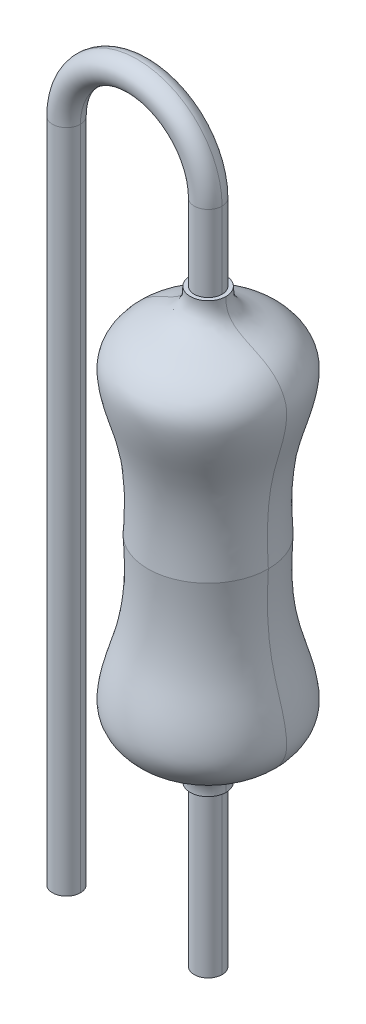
ISO-10303-21;
HEADER;
FILE_DESCRIPTION(('STEP AP214'),'2;1');
FILE_NAME('part.step','',(''),(''),'','','');
FILE_SCHEMA(('AUTOMOTIVE_DESIGN { 1 0 10303 214 1 1 1 1 }'));
ENDSEC;
DATA;
#1=APPLICATION_CONTEXT('core data for automotive mechanical design processes');
#2=APPLICATION_PROTOCOL_DEFINITION('international standard','automotive_design',2000,#1);
#3=PRODUCT_CONTEXT('',#1,'mechanical');
#4=PRODUCT('Part','Part','',(#3));
#5=PRODUCT_RELATED_PRODUCT_CATEGORY('part','',(#4));
#6=PRODUCT_DEFINITION_FORMATION('','',#4);
#7=PRODUCT_DEFINITION_CONTEXT('part definition',#1,'design');
#8=PRODUCT_DEFINITION('design','',#6,#7);
#9=PRODUCT_DEFINITION_SHAPE('','',#8);
#10=(LENGTH_UNIT() NAMED_UNIT(*) SI_UNIT(.MILLI.,.METRE.));
#11=(NAMED_UNIT(*) PLANE_ANGLE_UNIT() SI_UNIT($,.RADIAN.));
#12=(NAMED_UNIT(*) SI_UNIT($,.STERADIAN.) SOLID_ANGLE_UNIT());
#13=UNCERTAINTY_MEASURE_WITH_UNIT(LENGTH_MEASURE(1.E-05),#10,'distance_accuracy_value','');
#14=(GEOMETRIC_REPRESENTATION_CONTEXT(3) GLOBAL_UNCERTAINTY_ASSIGNED_CONTEXT((#13)) GLOBAL_UNIT_ASSIGNED_CONTEXT((#10,
#11,#12)) REPRESENTATION_CONTEXT('',''));
#15=CARTESIAN_POINT('',(0.,0.,0.));
#16=DIRECTION('',(0.,0.,1.));
#17=DIRECTION('',(1.,0.,0.));
#18=AXIS2_PLACEMENT_3D('',#15,#16,#17);
#19=CARTESIAN_POINT('',(0.,4.62500000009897,0.600000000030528));
#20=DIRECTION('',(-1.,0.,0.));
#21=DIRECTION('',(0.,0.,1.));
#22=AXIS2_PLACEMENT_3D('',#19,#20,#21);
#23=CIRCLE('',#22,1.62500000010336);
#24=TRIMMED_CURVE('',#23,(PARAMETER_VALUE(-1.94897749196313)),
(PARAMETER_VALUE(1.94897749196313)),.T.,.PARAMETER.);
#25=CARTESIAN_POINT('',(0.,4.62500000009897,0.));
#26=DIRECTION('',(0.,1.,0.));
#27=AXIS1_PLACEMENT('',#25,#26);
#28=SURFACE_OF_REVOLUTION('',#24,#27);
#29=CARTESIAN_POINT('',(0.,3.038139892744,0.));
#30=DIRECTION('',(0.,1.,0.));
#31=DIRECTION('',(-1.,0.,0.));
#32=AXIS2_PLACEMENT_3D('',#29,#30,#31);
#33=CIRCLE('',#32,0.25);
#34=CARTESIAN_POINT('',(-0.250000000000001,3.03813989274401,0.));
#35=VERTEX_POINT('',#34);
#36=CARTESIAN_POINT('',(0.250000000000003,3.038139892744,0.));
#37=VERTEX_POINT('',#36);
#38=EDGE_CURVE('P0_E58',#35,#37,#33,.T.);
#39=ORIENTED_EDGE('',*,*,#38,.F.);
#40=CARTESIAN_POINT('',(-0.600000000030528,4.62500000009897,0.));
#41=DIRECTION('',(0.,0.,-1.));
#42=DIRECTION('',(-1.,0.,0.));
#43=AXIS2_PLACEMENT_3D('',#40,#41,#42);
#44=CIRCLE('',#43,1.62500000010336);
#45=CARTESIAN_POINT('',(0.,3.11482616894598,0.));
#46=VERTEX_POINT('',#45);
#47=EDGE_CURVE('P0_E61',#46,#35,#44,.T.);
#48=ORIENTED_EDGE('',*,*,#47,.F.);
#49=CARTESIAN_POINT('',(0.60000000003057,4.62500000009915,0.));
#50=DIRECTION('',(0.,0.,-1.));
#51=DIRECTION('',(-1.,0.,0.));
#52=AXIS2_PLACEMENT_3D('',#49,#50,#51);
#53=CIRCLE('',#52,1.62500000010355);
#54=EDGE_CURVE('P0_E63',#37,#46,#53,.T.);
#55=ORIENTED_EDGE('',*,*,#54,.F.);
#56=EDGE_LOOP('',(#39,#48,#55));
#57=FACE_BOUND('',#56,.T.);
#58=ADVANCED_FACE('P0_F17',(#57),#28,.T.);
#59=CARTESIAN_POINT('',(0.,-6.6,0.));
#60=DIRECTION('',(0.,1.,0.));
#61=DIRECTION('',(-1.,0.,0.));
#62=AXIS2_PLACEMENT_3D('',#59,#60,#61);
#63=CYLINDRICAL_SURFACE('',#62,0.25);
#64=ORIENTED_EDGE('',*,*,#38,.T.);
#65=DIRECTION('',(0.,1.,0.));
#66=VECTOR('',#65,1.);
#67=CARTESIAN_POINT('',(0.250000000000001,-6.6,0.));
#68=LINE('',#67,#66);
#69=CARTESIAN_POINT('',(0.25,5.33,0.));
#70=VERTEX_POINT('',#69);
#71=EDGE_CURVE('P0_E76',#70,#37,#68,.F.);
#72=ORIENTED_EDGE('',*,*,#71,.F.);
#73=CARTESIAN_POINT('',(0.,5.33,0.));
#74=DIRECTION('',(0.,1.,0.));
#75=DIRECTION('',(0.,0.,1.));
#76=AXIS2_PLACEMENT_3D('',#73,#74,#75);
#77=CIRCLE('',#76,0.25);
#78=CARTESIAN_POINT('',(-0.25,5.33,0.));
#79=VERTEX_POINT('',#78);
#80=EDGE_CURVE('P0_E70',#79,#70,#77,.T.);
#81=ORIENTED_EDGE('',*,*,#80,.F.);
#82=DIRECTION('',(0.,1.,0.));
#83=VECTOR('',#82,1.);
#84=CARTESIAN_POINT('',(-0.249999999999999,-6.6,0.));
#85=LINE('',#84,#83);
#86=EDGE_CURVE('P0_E68',#35,#79,#85,.T.);
#87=ORIENTED_EDGE('',*,*,#86,.F.);
#88=EDGE_LOOP('',(#64,#72,#81,#87));
#89=FACE_BOUND('',#88,.T.);
#90=ADVANCED_FACE('P0_F69',(#89),#63,.T.);
#91=CARTESIAN_POINT('',(0.,4.62500000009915,0.60000000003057));
#92=DIRECTION('',(-1.,0.,0.));
#93=DIRECTION('',(0.,0.,1.));
#94=AXIS2_PLACEMENT_3D('',#91,#92,#93);
#95=CIRCLE('',#94,1.62500000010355);
#96=TRIMMED_CURVE('',#95,(PARAMETER_VALUE(-1.94897749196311)),
(PARAMETER_VALUE(1.94897749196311)),.T.,.PARAMETER.);
#97=CARTESIAN_POINT('',(0.,4.62500000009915,0.));
#98=DIRECTION('',(0.,1.,0.));
#99=AXIS1_PLACEMENT('',#97,#98);
#100=SURFACE_OF_REVOLUTION('',#96,#99);
#101=ORIENTED_EDGE('',*,*,#54,.T.);
#102=ORIENTED_EDGE('',*,*,#47,.T.);
#103=CARTESIAN_POINT('',(0.,3.038139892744,0.));
#104=DIRECTION('',(0.,1.,0.));
#105=DIRECTION('',(-1.,0.,0.));
#106=AXIS2_PLACEMENT_3D('',#103,#104,#105);
#107=CIRCLE('',#106,0.25);
#108=EDGE_CURVE('P0_E80',#37,#35,#107,.T.);
#109=ORIENTED_EDGE('',*,*,#108,.F.);
#110=EDGE_LOOP('',(#101,#102,#109));
#111=FACE_BOUND('',#110,.T.);
#112=ADVANCED_FACE('P0_F79',(#111),#100,.T.);
#113=CARTESIAN_POINT('',(-1.27,5.33,0.));
#114=DIRECTION('',(0.,0.,1.));
#115=DIRECTION('',(0.,-1.,0.));
#116=AXIS2_PLACEMENT_3D('',#113,#114,#115);
#117=TOROIDAL_SURFACE('',#116,1.27,0.25);
#118=ORIENTED_EDGE('',*,*,#80,.T.);
#119=CARTESIAN_POINT('',(-1.27,5.33,0.));
#120=DIRECTION('',(0.,0.,-1.));
#121=DIRECTION('',(-1.,0.,0.));
#122=AXIS2_PLACEMENT_3D('',#119,#120,#121);
#123=CIRCLE('',#122,1.52);
#124=CARTESIAN_POINT('',(-2.79,5.33,0.));
#125=VERTEX_POINT('',#124);
#126=EDGE_CURVE('P0_E36',#125,#70,#123,.T.);
#127=ORIENTED_EDGE('',*,*,#126,.F.);
#128=CARTESIAN_POINT('',(-2.54,5.33,0.));
#129=DIRECTION('',(0.,-1.,0.));
#130=DIRECTION('',(1.,0.,0.));
#131=AXIS2_PLACEMENT_3D('',#128,#129,#130);
#132=CIRCLE('',#131,0.25);
#133=CARTESIAN_POINT('',(-2.29,5.33,0.));
#134=VERTEX_POINT('',#133);
#135=EDGE_CURVE('P0_E86',#134,#125,#132,.T.);
#136=ORIENTED_EDGE('',*,*,#135,.F.);
#137=CARTESIAN_POINT('',(-1.27,5.33,0.));
#138=DIRECTION('',(0.,0.,1.));
#139=DIRECTION('',(0.,-1.,0.));
#140=AXIS2_PLACEMENT_3D('',#137,#138,#139);
#141=CIRCLE('',#140,1.02);
#142=EDGE_CURVE('P0_E115',#79,#134,#141,.T.);
#143=ORIENTED_EDGE('',*,*,#142,.F.);
#144=EDGE_LOOP('',(#118,#127,#136,#143));
#145=FACE_BOUND('',#144,.T.);
#146=ADVANCED_FACE('P0_F141',(#145),#117,.T.);
#147=CARTESIAN_POINT('',(0.,-6.6,0.));
#148=DIRECTION('',(0.,1.,0.));
#149=DIRECTION('',(-1.,0.,0.));
#150=AXIS2_PLACEMENT_3D('',#147,#148,#149);
#151=CYLINDRICAL_SURFACE('',#150,0.25);
#152=ORIENTED_EDGE('',*,*,#71,.T.);
#153=ORIENTED_EDGE('',*,*,#108,.T.);
#154=ORIENTED_EDGE('',*,*,#86,.T.);
#155=CARTESIAN_POINT('',(0.,5.33,0.));
#156=DIRECTION('',(0.,1.,0.));
#157=DIRECTION('',(0.,0.,1.));
#158=AXIS2_PLACEMENT_3D('',#155,#156,#157);
#159=CIRCLE('',#158,0.25);
#160=EDGE_CURVE('P0_E105',#70,#79,#159,.T.);
#161=ORIENTED_EDGE('',*,*,#160,.F.);
#162=EDGE_LOOP('',(#152,#153,#154,#161));
#163=FACE_BOUND('',#162,.T.);
#164=ADVANCED_FACE('P0_F83',(#163),#151,.T.);
#165=CARTESIAN_POINT('',(-2.54,-6.6,0.));
#166=DIRECTION('',(0.,-1.,0.));
#167=DIRECTION('',(1.,0.,0.));
#168=AXIS2_PLACEMENT_3D('',#165,#166,#167);
#169=PLANE('',#168);
#170=CARTESIAN_POINT('',(-2.54,-6.6,0.));
#171=DIRECTION('',(0.,-1.,0.));
#172=DIRECTION('',(1.,0.,0.));
#173=AXIS2_PLACEMENT_3D('',#170,#171,#172);
#174=CIRCLE('',#173,0.25);
#175=CARTESIAN_POINT('',(-2.79,-6.6,0.));
#176=VERTEX_POINT('',#175);
#177=CARTESIAN_POINT('',(-2.29,-6.6,0.));
#178=VERTEX_POINT('',#177);
#179=EDGE_CURVE('P0_E21',#176,#178,#174,.F.);
#180=ORIENTED_EDGE('',*,*,#179,.F.);
#181=CARTESIAN_POINT('',(-2.54,-6.6,0.));
#182=DIRECTION('',(0.,-1.,0.));
#183=DIRECTION('',(1.,0.,0.));
#184=AXIS2_PLACEMENT_3D('',#181,#182,#183);
#185=CIRCLE('',#184,0.25);
#186=EDGE_CURVE('P0_E97',#178,#176,#185,.F.);
#187=ORIENTED_EDGE('',*,*,#186,.F.);
#188=EDGE_LOOP('',(#180,#187));
#189=FACE_BOUND('',#188,.T.);
#190=ADVANCED_FACE('P0_F148',(#189),#169,.T.);
#191=CARTESIAN_POINT('',(-2.54,5.33,0.));
#192=DIRECTION('',(0.,-1.,0.));
#193=DIRECTION('',(1.,0.,0.));
#194=AXIS2_PLACEMENT_3D('',#191,#192,#193);
#195=CYLINDRICAL_SURFACE('',#194,0.25);
#196=ORIENTED_EDGE('',*,*,#135,.T.);
#197=DIRECTION('',(0.,-1.,0.));
#198=VECTOR('',#197,1.);
#199=CARTESIAN_POINT('',(-2.79,5.33,0.));
#200=LINE('',#199,#198);
#201=EDGE_CURVE('P0_E27',#176,#125,#200,.F.);
#202=ORIENTED_EDGE('',*,*,#201,.F.);
#203=ORIENTED_EDGE('',*,*,#179,.T.);
#204=DIRECTION('',(0.,-1.,0.));
#205=VECTOR('',#204,1.);
#206=CARTESIAN_POINT('',(-2.29,5.33,0.));
#207=LINE('',#206,#205);
#208=EDGE_CURVE('P0_E99',#134,#178,#207,.T.);
#209=ORIENTED_EDGE('',*,*,#208,.F.);
#210=EDGE_LOOP('',(#196,#202,#203,#209));
#211=FACE_BOUND('',#210,.T.);
#212=ADVANCED_FACE('P0_F140',(#211),#195,.T.);
#213=CARTESIAN_POINT('',(-1.27,5.33,0.));
#214=DIRECTION('',(0.,0.,1.));
#215=DIRECTION('',(1.,0.,0.));
#216=AXIS2_PLACEMENT_3D('',#213,#214,#215);
#217=TOROIDAL_SURFACE('',#216,1.27,0.25);
#218=ORIENTED_EDGE('',*,*,#126,.T.);
#219=ORIENTED_EDGE('',*,*,#160,.T.);
#220=ORIENTED_EDGE('',*,*,#142,.T.);
#221=CARTESIAN_POINT('',(-2.54,5.33,0.));
#222=DIRECTION('',(0.,-1.,0.));
#223=DIRECTION('',(1.,0.,0.));
#224=AXIS2_PLACEMENT_3D('',#221,#222,#223);
#225=CIRCLE('',#224,0.25);
#226=EDGE_CURVE('P0_E11',#125,#134,#225,.T.);
#227=ORIENTED_EDGE('',*,*,#226,.F.);
#228=EDGE_LOOP('',(#218,#219,#220,#227));
#229=FACE_BOUND('',#228,.T.);
#230=ADVANCED_FACE('P0_F19',(#229),#217,.T.);
#231=CARTESIAN_POINT('',(-2.54,5.33,0.));
#232=DIRECTION('',(0.,-1.,0.));
#233=DIRECTION('',(1.,0.,0.));
#234=AXIS2_PLACEMENT_3D('',#231,#232,#233);
#235=CYLINDRICAL_SURFACE('',#234,0.25);
#236=ORIENTED_EDGE('',*,*,#201,.T.);
#237=ORIENTED_EDGE('',*,*,#226,.T.);
#238=ORIENTED_EDGE('',*,*,#208,.T.);
#239=ORIENTED_EDGE('',*,*,#186,.T.);
#240=EDGE_LOOP('',(#236,#237,#238,#239));
#241=FACE_BOUND('',#240,.T.);
#242=ADVANCED_FACE('P0_F138',(#241),#235,.T.);
#243=CLOSED_SHELL('',(#58,#90,#112,#146,#164,#190,#212,#230,#242));
#244=MANIFOLD_SOLID_BREP('P0_B1',#243);
#245=CARTESIAN_POINT('',(-0.0007931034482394,3.961860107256,0.));
#246=DIRECTION('',(0.,1.,0.));
#247=DIRECTION('',(-1.,0.,0.));
#248=AXIS2_PLACEMENT_3D('',#245,#246,#247);
#249=PLANE('',#248);
#250=CARTESIAN_POINT('',(-0.320793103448,3.961860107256,0.));
#251=CARTESIAN_POINT('',(-0.320808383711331,3.961860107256,0.018002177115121));
#252=CARTESIAN_POINT('',(-0.319274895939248,3.961860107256,0.0359997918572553));
#253=CARTESIAN_POINT('',(-0.313223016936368,3.961860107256,0.0714731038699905));
#254=CARTESIAN_POINT('',(-0.30870681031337,3.961860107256,0.0889491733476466));
#255=CARTESIAN_POINT('',(-0.296799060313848,3.961860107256,0.122902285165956));
#256=CARTESIAN_POINT('',(-0.289406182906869,3.961860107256,0.139378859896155));
#257=CARTESIAN_POINT('',(-0.271961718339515,3.961860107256,0.170854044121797));
#258=CARTESIAN_POINT('',(-0.261910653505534,3.961860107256,0.18585294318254));
#259=CARTESIAN_POINT('',(-0.239439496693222,3.961860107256,0.213942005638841));
#260=CARTESIAN_POINT('',(-0.227020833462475,3.961860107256,0.227033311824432));
#261=CARTESIAN_POINT('',(-0.200145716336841,3.961860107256,0.250963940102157));
#262=CARTESIAN_POINT('',(-0.1856864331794,3.961860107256,0.261800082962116));
#263=CARTESIAN_POINT('',(-0.155169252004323,3.961860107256,0.280874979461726));
#264=CARTESIAN_POINT('',(-0.139113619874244,3.961860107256,0.289117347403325));
#265=CARTESIAN_POINT('',(-0.105842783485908,3.961860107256,0.302804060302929));
#266=CARTESIAN_POINT('',(-0.0886259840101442,3.961860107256,0.308244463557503));
#267=CARTESIAN_POINT('',(-0.0360139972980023,3.961860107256,0.320061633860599));
#268=CARTESIAN_POINT('',(0.000479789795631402,3.961860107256,0.32201854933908));
#269=CARTESIAN_POINT('',(0.0720386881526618,3.961860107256,0.313676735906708));
#270=CARTESIAN_POINT('',(0.10710379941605,3.961860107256,0.303378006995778));
#271=CARTESIAN_POINT('',(0.155586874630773,3.961860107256,0.279775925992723));
#272=CARTESIAN_POINT('',(0.171090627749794,3.961860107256,0.270521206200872));
#273=CARTESIAN_POINT('',(0.200321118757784,3.961860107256,0.24954853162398));
#274=CARTESIAN_POINT('',(0.214050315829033,3.961860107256,0.237834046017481));
#275=CARTESIAN_POINT('',(0.239361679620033,3.961860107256,0.212251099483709));
#276=CARTESIAN_POINT('',(0.250940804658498,3.961860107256,0.198379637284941));
#277=CARTESIAN_POINT('',(0.271590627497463,3.961860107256,0.16890867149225));
#278=CARTESIAN_POINT('',(0.280664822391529,3.961860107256,0.153311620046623));
#279=CARTESIAN_POINT('',(0.296079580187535,3.961860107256,0.120793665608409));
#280=CARTESIAN_POINT('',(0.302416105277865,3.961860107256,0.103870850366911));
#281=CARTESIAN_POINT('',(0.312145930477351,3.961860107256,0.0692226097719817));
#282=CARTESIAN_POINT('',(0.315543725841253,3.961860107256,0.051498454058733));
#283=CARTESIAN_POINT('',(0.318617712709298,3.961860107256,0.022453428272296));
#284=CARTESIAN_POINT('',(0.319211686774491,3.961860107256,0.0112237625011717));
#285=CARTESIAN_POINT('',(0.319206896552,3.961860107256,0.));
#286=B_SPLINE_CURVE_WITH_KNOTS('',3,(#250,#251,#252,#253,#254,#255,#256,#257,#258,#259,#260,
#261,#262,#263,#264,#265,#266,#267,#268,#269,#270,#271,#272,#273,#274,#275,#276,#277,#278,#279,
#280,#281,#282,#283,#284,#285),.UNSPECIFIED.,.F.,.F.,(4,2,2,2,2,2,2,2,2,2,2,2,2,2,2,2,2,4),(0.,
0.0539348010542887,0.107830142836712,0.161750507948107,0.215660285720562,0.269537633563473,
0.323490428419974,0.377367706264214,0.431320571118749,0.538767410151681,0.646214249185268,
0.700167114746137,0.754044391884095,0.807997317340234,0.861874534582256,0.91583094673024,
0.969704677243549,1.00337593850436),.UNSPECIFIED.);
#287=CARTESIAN_POINT('',(-0.320793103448,3.961860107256,0.));
#288=VERTEX_POINT('',#287);
#289=CARTESIAN_POINT('',(0.319206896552,3.961860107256,0.));
#290=VERTEX_POINT('',#289);
#291=EDGE_CURVE('P1_E21',#288,#290,#286,.T.);
#292=ORIENTED_EDGE('',*,*,#291,.T.);
#293=CARTESIAN_POINT('',(0.319206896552,3.961860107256,0.));
#294=CARTESIAN_POINT('',(0.319222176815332,3.961860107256,-0.018002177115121));
#295=CARTESIAN_POINT('',(0.317688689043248,3.961860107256,-0.0359997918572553));
#296=CARTESIAN_POINT('',(0.311636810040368,3.961860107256,-0.0714731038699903));
#297=CARTESIAN_POINT('',(0.30712060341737,3.961860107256,-0.0889491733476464));
#298=CARTESIAN_POINT('',(0.295212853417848,3.961860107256,-0.122902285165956));
#299=CARTESIAN_POINT('',(0.287819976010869,3.961860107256,-0.139378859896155));
#300=CARTESIAN_POINT('',(0.270375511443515,3.961860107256,-0.170854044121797));
#301=CARTESIAN_POINT('',(0.260324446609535,3.961860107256,-0.18585294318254));
#302=CARTESIAN_POINT('',(0.237853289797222,3.961860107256,-0.21394200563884));
#303=CARTESIAN_POINT('',(0.225434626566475,3.961860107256,-0.227033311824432));
#304=CARTESIAN_POINT('',(0.198559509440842,3.961860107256,-0.250963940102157));
#305=CARTESIAN_POINT('',(0.184100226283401,3.961860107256,-0.261800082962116));
#306=CARTESIAN_POINT('',(0.153583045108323,3.961860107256,-0.280874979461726));
#307=CARTESIAN_POINT('',(0.137527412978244,3.961860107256,-0.289117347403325));
#308=CARTESIAN_POINT('',(0.104256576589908,3.961860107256,-0.302804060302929));
#309=CARTESIAN_POINT('',(0.0870397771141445,3.961860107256,-0.308244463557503));
#310=CARTESIAN_POINT('',(0.0344277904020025,3.961860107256,-0.320061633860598));
#311=CARTESIAN_POINT('',(-0.00206599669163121,3.961860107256,-0.32201854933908));
#312=CARTESIAN_POINT('',(-0.0736248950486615,3.961860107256,-0.313676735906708));
#313=CARTESIAN_POINT('',(-0.108690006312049,3.961860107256,-0.303378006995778));
#314=CARTESIAN_POINT('',(-0.157173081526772,3.961860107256,-0.279775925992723));
#315=CARTESIAN_POINT('',(-0.172676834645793,3.961860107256,-0.270521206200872));
#316=CARTESIAN_POINT('',(-0.201907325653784,3.961860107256,-0.24954853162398));
#317=CARTESIAN_POINT('',(-0.215636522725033,3.961860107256,-0.237834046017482));
#318=CARTESIAN_POINT('',(-0.240947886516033,3.961860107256,-0.212251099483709));
#319=CARTESIAN_POINT('',(-0.252527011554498,3.961860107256,-0.198379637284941));
#320=CARTESIAN_POINT('',(-0.273176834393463,3.961860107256,-0.16890867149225));
#321=CARTESIAN_POINT('',(-0.282251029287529,3.961860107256,-0.153311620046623));
#322=CARTESIAN_POINT('',(-0.297665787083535,3.961860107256,-0.120793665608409));
#323=CARTESIAN_POINT('',(-0.304002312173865,3.961860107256,-0.103870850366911));
#324=CARTESIAN_POINT('',(-0.31373213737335,3.961860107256,-0.0692226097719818));
#325=CARTESIAN_POINT('',(-0.317129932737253,3.961860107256,-0.0514984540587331));
#326=CARTESIAN_POINT('',(-0.320203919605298,3.961860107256,-0.0224534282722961));
#327=CARTESIAN_POINT('',(-0.320797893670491,3.961860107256,-0.0112237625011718));
#328=CARTESIAN_POINT('',(-0.320793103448,3.961860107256,0.));
#329=B_SPLINE_CURVE_WITH_KNOTS('',3,(#293,#294,#295,#296,#297,#298,#299,#300,#301,#302,#303,
#304,#305,#306,#307,#308,#309,#310,#311,#312,#313,#314,#315,#316,#317,#318,#319,#320,#321,#322,
#323,#324,#325,#326,#327,#328),.UNSPECIFIED.,.F.,.F.,(4,2,2,2,2,2,2,2,2,2,2,2,2,2,2,2,2,4),(0.,
0.0539348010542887,0.107830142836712,0.161750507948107,0.215660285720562,0.269537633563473,
0.323490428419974,0.377367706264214,0.431320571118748,0.538767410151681,0.646214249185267,
0.700167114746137,0.754044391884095,0.807997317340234,0.861874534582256,0.91583094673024,
0.969704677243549,1.00337593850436),.UNSPECIFIED.);
#330=EDGE_CURVE('P1_E56',#290,#288,#329,.T.);
#331=ORIENTED_EDGE('',*,*,#330,.T.);
#332=EDGE_LOOP('',(#292,#331));
#333=FACE_BOUND('',#332,.T.);
#334=ADVANCED_FACE('P1_F17',(#333),#249,.T.);
#335=CARTESIAN_POINT('',(0.319206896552,3.961860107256,0.));
#336=CARTESIAN_POINT('',(0.319206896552,3.961860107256,0.64));
#337=CARTESIAN_POINT('',(-0.320793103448,3.961860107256,0.64));
#338=CARTESIAN_POINT('',(-0.320793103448,3.961860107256,0.));
#339=CARTESIAN_POINT('',(0.291595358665,3.487861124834,0.));
#340=CARTESIAN_POINT('',(0.291595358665,3.487861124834,0.584776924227));
#341=CARTESIAN_POINT('',(-0.293181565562,3.487861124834,0.584776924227));
#342=CARTESIAN_POINT('',(-0.293181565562,3.487861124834,0.));
#343=CARTESIAN_POINT('',(1.018011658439,3.458064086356,0.));
#344=CARTESIAN_POINT('',(1.018011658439,3.458064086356,2.037609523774));
#345=CARTESIAN_POINT('',(-1.019597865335,3.458064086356,2.037609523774));
#346=CARTESIAN_POINT('',(-1.019597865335,3.458064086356,0.));
#347=CARTESIAN_POINT('',(1.421439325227,2.883908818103,0.));
#348=CARTESIAN_POINT('',(1.421439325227,2.883908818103,2.84446485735));
#349=CARTESIAN_POINT('',(-1.423025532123,2.883908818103,2.84446485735));
#350=CARTESIAN_POINT('',(-1.423025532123,2.883908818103,0.));
#351=CARTESIAN_POINT('',(1.394059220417,2.312624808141,0.));
#352=CARTESIAN_POINT('',(1.394059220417,2.312624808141,2.789704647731));
#353=CARTESIAN_POINT('',(-1.395645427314,2.312624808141,2.789704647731));
#354=CARTESIAN_POINT('',(-1.395645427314,2.312624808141,0.));
#355=CARTESIAN_POINT('',(1.054659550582,1.466928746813,0.));
#356=CARTESIAN_POINT('',(1.054659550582,1.466928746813,2.110905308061));
#357=CARTESIAN_POINT('',(-1.056245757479,1.466928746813,2.110905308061));
#358=CARTESIAN_POINT('',(-1.056245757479,1.466928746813,0.));
#359=CARTESIAN_POINT('',(1.045853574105,0.625140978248,0.));
#360=CARTESIAN_POINT('',(1.045853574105,0.625140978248,2.093293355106));
#361=CARTESIAN_POINT('',(-1.047439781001,0.625140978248,2.093293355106));
#362=CARTESIAN_POINT('',(-1.047439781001,0.625140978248,0.));
#363=CARTESIAN_POINT('',(1.077965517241,0.112653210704,0.));
#364=CARTESIAN_POINT('',(1.077965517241,0.112653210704,2.157517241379));
#365=CARTESIAN_POINT('',(-1.079551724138,0.112653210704,2.157517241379));
#366=CARTESIAN_POINT('',(-1.079551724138,0.112653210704,0.));
#367=(BOUNDED_SURFACE() B_SPLINE_SURFACE(3,3,((#335,#336,#337,#338),(#339,#340,#341,#342),(#343,
#344,#345,#346),(#347,#348,#349,#350),(#351,#352,#353,#354),(#355,#356,#357,#358),(#359,#360,
#361,#362),(#363,#364,#365,#366)),.UNSPECIFIED.,.F.,.F.,.F.) B_SPLINE_SURFACE_WITH_KNOTS((4,1,1,
1,1,4),(4,4),(0.,0.261385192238,0.381801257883,0.437792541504,0.645704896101,1.),(0.,1.),
.UNSPECIFIED.) GEOMETRIC_REPRESENTATION_ITEM() RATIONAL_B_SPLINE_SURFACE(((1.,0.333333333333,
0.333333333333,1.),(1.,0.333333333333,0.333333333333,1.),(1.,0.333333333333,0.333333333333,1.),
(1.,0.333333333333,0.333333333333,1.),(1.,0.333333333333,0.333333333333,1.),(1.,0.333333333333,
0.333333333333,1.),(1.,0.333333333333,0.333333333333,1.),(1.,0.333333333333,0.333333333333,1.))) REPRESENTATION_ITEM('') SURFACE());
#368=CARTESIAN_POINT('',(-0.320793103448,3.961860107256,0.));
#369=CARTESIAN_POINT('',(-0.293181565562,3.487861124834,0.));
#370=CARTESIAN_POINT('',(-1.019597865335,3.458064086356,0.));
#371=CARTESIAN_POINT('',(-1.423025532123,2.883908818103,0.));
#372=CARTESIAN_POINT('',(-1.395645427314,2.312624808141,0.));
#373=CARTESIAN_POINT('',(-1.056245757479,1.466928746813,0.));
#374=CARTESIAN_POINT('',(-1.047439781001,0.625140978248,0.));
#375=CARTESIAN_POINT('',(-1.079551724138,0.112653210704,0.));
#376=B_SPLINE_CURVE_WITH_KNOTS('',3,(#368,#369,#370,#371,#372,#373,#374,#375),.UNSPECIFIED.,.F.,
.F.,(4,1,1,1,1,4),(0.,0.261385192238,0.381801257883,0.437792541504,0.645704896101,1.),.UNSPECIFIED.);
#377=CARTESIAN_POINT('',(-1.079551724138,0.112653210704,0.));
#378=VERTEX_POINT('',#377);
#379=EDGE_CURVE('P1_E61',#288,#378,#376,.T.);
#380=CARTESIAN_POINT('',(-0.000793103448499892,0.112653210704,0.));
#381=DIRECTION('',(0.,1.,0.));
#382=DIRECTION('',(0.,0.,1.));
#383=AXIS2_PLACEMENT_3D('',#380,#381,#382);
#384=CIRCLE('',#383,1.0787586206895);
#385=CARTESIAN_POINT('',(1.077965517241,0.112653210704,0.));
#386=VERTEX_POINT('',#385);
#387=EDGE_CURVE('P1_E66',#378,#386,#384,.T.);
#388=CARTESIAN_POINT('',(0.319206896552,3.961860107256,0.));
#389=CARTESIAN_POINT('',(0.291595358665,3.487861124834,0.));
#390=CARTESIAN_POINT('',(1.018011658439,3.458064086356,0.));
#391=CARTESIAN_POINT('',(1.421439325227,2.883908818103,0.));
#392=CARTESIAN_POINT('',(1.394059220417,2.312624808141,0.));
#393=CARTESIAN_POINT('',(1.054659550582,1.466928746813,0.));
#394=CARTESIAN_POINT('',(1.045853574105,0.625140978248,0.));
#395=CARTESIAN_POINT('',(1.077965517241,0.112653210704,0.));
#396=B_SPLINE_CURVE_WITH_KNOTS('',3,(#388,#389,#390,#391,#392,#393,#394,#395),.UNSPECIFIED.,.F.,
.F.,(4,1,1,1,1,4),(0.,0.261385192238,0.381801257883,0.437792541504,0.645704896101,1.),.UNSPECIFIED.);
#397=EDGE_CURVE('P1_E59',#386,#290,#396,.F.);
#398=ORIENTED_EDGE('',*,*,#379,.T.);
#399=ORIENTED_EDGE('',*,*,#387,.T.);
#400=ORIENTED_EDGE('',*,*,#397,.T.);
#401=ORIENTED_EDGE('',*,*,#291,.F.);
#402=EDGE_LOOP('',(#398,#399,#400,#401));
#403=FACE_BOUND('',#402,.T.);
#404=ADVANCED_FACE('P1_F64',(#403),#367,.F.);
#405=CARTESIAN_POINT('',(-0.320793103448,3.961860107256,0.));
#406=CARTESIAN_POINT('',(-0.320793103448,3.961860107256,-0.64));
#407=CARTESIAN_POINT('',(0.319206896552,3.961860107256,-0.64));
#408=CARTESIAN_POINT('',(0.319206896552,3.961860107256,0.));
#409=CARTESIAN_POINT('',(-0.293181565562,3.487861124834,0.));
#410=CARTESIAN_POINT('',(-0.293181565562,3.487861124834,-0.584776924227));
#411=CARTESIAN_POINT('',(0.291595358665,3.487861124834,-0.584776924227));
#412=CARTESIAN_POINT('',(0.291595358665,3.487861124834,0.));
#413=CARTESIAN_POINT('',(-1.019597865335,3.458064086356,0.));
#414=CARTESIAN_POINT('',(-1.019597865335,3.458064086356,-2.037609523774));
#415=CARTESIAN_POINT('',(1.018011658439,3.458064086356,-2.037609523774));
#416=CARTESIAN_POINT('',(1.018011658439,3.458064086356,0.));
#417=CARTESIAN_POINT('',(-1.423025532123,2.883908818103,0.));
#418=CARTESIAN_POINT('',(-1.423025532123,2.883908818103,-2.84446485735));
#419=CARTESIAN_POINT('',(1.421439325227,2.883908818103,-2.84446485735));
#420=CARTESIAN_POINT('',(1.421439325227,2.883908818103,0.));
#421=CARTESIAN_POINT('',(-1.395645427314,2.312624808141,0.));
#422=CARTESIAN_POINT('',(-1.395645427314,2.312624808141,-2.789704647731));
#423=CARTESIAN_POINT('',(1.394059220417,2.312624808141,-2.789704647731));
#424=CARTESIAN_POINT('',(1.394059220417,2.312624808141,0.));
#425=CARTESIAN_POINT('',(-1.056245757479,1.466928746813,0.));
#426=CARTESIAN_POINT('',(-1.056245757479,1.466928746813,-2.110905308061));
#427=CARTESIAN_POINT('',(1.054659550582,1.466928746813,-2.110905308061));
#428=CARTESIAN_POINT('',(1.054659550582,1.466928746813,0.));
#429=CARTESIAN_POINT('',(-1.047439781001,0.625140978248,0.));
#430=CARTESIAN_POINT('',(-1.047439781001,0.625140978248,-2.093293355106));
#431=CARTESIAN_POINT('',(1.045853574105,0.625140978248,-2.093293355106));
#432=CARTESIAN_POINT('',(1.045853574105,0.625140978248,0.));
#433=CARTESIAN_POINT('',(-1.079551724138,0.112653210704,0.));
#434=CARTESIAN_POINT('',(-1.079551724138,0.112653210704,-2.157517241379));
#435=CARTESIAN_POINT('',(1.077965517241,0.112653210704,-2.157517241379));
#436=CARTESIAN_POINT('',(1.077965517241,0.112653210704,0.));
#437=(BOUNDED_SURFACE() B_SPLINE_SURFACE(3,3,((#405,#406,#407,#408),(#409,#410,#411,#412),(#413,
#414,#415,#416),(#417,#418,#419,#420),(#421,#422,#423,#424),(#425,#426,#427,#428),(#429,#430,
#431,#432),(#433,#434,#435,#436)),.UNSPECIFIED.,.F.,.F.,.F.) B_SPLINE_SURFACE_WITH_KNOTS((4,1,1,
1,1,4),(4,4),(0.,0.261385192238,0.381801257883,0.437792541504,0.645704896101,1.),(0.,1.),
.UNSPECIFIED.) GEOMETRIC_REPRESENTATION_ITEM() RATIONAL_B_SPLINE_SURFACE(((1.,0.333333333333,
0.333333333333,1.),(1.,0.333333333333,0.333333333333,1.),(1.,0.333333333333,0.333333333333,1.),
(1.,0.333333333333,0.333333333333,1.),(1.,0.333333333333,0.333333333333,1.),(1.,0.333333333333,
0.333333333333,1.),(1.,0.333333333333,0.333333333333,1.),(1.,0.333333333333,0.333333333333,1.))) REPRESENTATION_ITEM('') SURFACE());
#438=CARTESIAN_POINT('',(-0.000793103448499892,0.112653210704,0.));
#439=DIRECTION('',(0.,1.,0.));
#440=DIRECTION('',(0.,0.,1.));
#441=AXIS2_PLACEMENT_3D('',#438,#439,#440);
#442=CIRCLE('',#441,1.0787586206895);
#443=EDGE_CURVE('P1_E124',#386,#378,#442,.T.);
#444=ORIENTED_EDGE('',*,*,#443,.T.);
#445=ORIENTED_EDGE('',*,*,#379,.F.);
#446=ORIENTED_EDGE('',*,*,#330,.F.);
#447=ORIENTED_EDGE('',*,*,#397,.F.);
#448=EDGE_LOOP('',(#444,#445,#446,#447));
#449=FACE_BOUND('',#448,.T.);
#450=ADVANCED_FACE('P1_F58',(#449),#437,.F.);
#451=CARTESIAN_POINT('',(-0.320793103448,-3.736553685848,-1.413653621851));
#452=DIRECTION('',(0.,1.,0.));
#453=DIRECTION('',(-1.,0.,0.));
#454=AXIS2_PLACEMENT_3D('',#451,#452,#453);
#455=PLANE('',#454);
#456=CARTESIAN_POINT('',(0.319206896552,-3.736553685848,0.));
#457=CARTESIAN_POINT('',(0.319222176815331,-3.736553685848,0.0180021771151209));
#458=CARTESIAN_POINT('',(0.317688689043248,-3.736553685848,0.0359997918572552));
#459=CARTESIAN_POINT('',(0.311636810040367,-3.736553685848,0.0714731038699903));
#460=CARTESIAN_POINT('',(0.30712060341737,-3.736553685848,0.0889491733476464));
#461=CARTESIAN_POINT('',(0.295212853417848,-3.736553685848,0.122902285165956));
#462=CARTESIAN_POINT('',(0.287819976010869,-3.736553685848,0.139378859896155));
#463=CARTESIAN_POINT('',(0.270375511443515,-3.736553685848,0.170854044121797));
#464=CARTESIAN_POINT('',(0.260324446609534,-3.736553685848,0.18585294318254));
#465=CARTESIAN_POINT('',(0.237853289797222,-3.736553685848,0.21394200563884));
#466=CARTESIAN_POINT('',(0.225434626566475,-3.736553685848,0.227033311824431));
#467=CARTESIAN_POINT('',(0.198559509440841,-3.736553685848,0.250963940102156));
#468=CARTESIAN_POINT('',(0.184100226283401,-3.736553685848,0.261800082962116));
#469=CARTESIAN_POINT('',(0.153583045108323,-3.736553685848,0.280874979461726));
#470=CARTESIAN_POINT('',(0.137527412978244,-3.736553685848,0.289117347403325));
#471=CARTESIAN_POINT('',(0.104256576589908,-3.736553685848,0.302804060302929));
#472=CARTESIAN_POINT('',(0.0870397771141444,-3.736553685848,0.308244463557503));
#473=CARTESIAN_POINT('',(0.0344277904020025,-3.736553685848,0.320061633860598));
#474=CARTESIAN_POINT('',(-0.00206599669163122,-3.736553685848,0.32201854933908));
#475=CARTESIAN_POINT('',(-0.0736248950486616,-3.736553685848,0.313676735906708));
#476=CARTESIAN_POINT('',(-0.10869000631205,-3.736553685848,0.303378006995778));
#477=CARTESIAN_POINT('',(-0.157173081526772,-3.736553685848,0.279775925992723));
#478=CARTESIAN_POINT('',(-0.172676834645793,-3.736553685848,0.270521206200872));
#479=CARTESIAN_POINT('',(-0.201907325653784,-3.736553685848,0.24954853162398));
#480=CARTESIAN_POINT('',(-0.215636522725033,-3.736553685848,0.237834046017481));
#481=CARTESIAN_POINT('',(-0.240947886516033,-3.736553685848,0.212251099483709));
#482=CARTESIAN_POINT('',(-0.252527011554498,-3.736553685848,0.198379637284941));
#483=CARTESIAN_POINT('',(-0.273176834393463,-3.736553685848,0.16890867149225));
#484=CARTESIAN_POINT('',(-0.282251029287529,-3.736553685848,0.153311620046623));
#485=CARTESIAN_POINT('',(-0.297665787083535,-3.736553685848,0.120793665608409));
#486=CARTESIAN_POINT('',(-0.304002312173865,-3.736553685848,0.103870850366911));
#487=CARTESIAN_POINT('',(-0.31373213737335,-3.736553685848,0.0692226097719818));
#488=CARTESIAN_POINT('',(-0.317129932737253,-3.736553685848,0.0514984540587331));
#489=CARTESIAN_POINT('',(-0.320203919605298,-3.736553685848,0.0224534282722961));
#490=CARTESIAN_POINT('',(-0.320797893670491,-3.736553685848,0.0112237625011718));
#491=CARTESIAN_POINT('',(-0.320793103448,-3.736553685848,0.));
#492=B_SPLINE_CURVE_WITH_KNOTS('',3,(#456,#457,#458,#459,#460,#461,#462,#463,#464,#465,#466,
#467,#468,#469,#470,#471,#472,#473,#474,#475,#476,#477,#478,#479,#480,#481,#482,#483,#484,#485,
#486,#487,#488,#489,#490,#491),.UNSPECIFIED.,.F.,.F.,(4,2,2,2,2,2,2,2,2,2,2,2,2,2,2,2,2,4),(0.,
0.0539348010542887,0.107830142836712,0.161750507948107,0.215660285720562,0.269537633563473,
0.323490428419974,0.377367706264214,0.431320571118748,0.538767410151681,0.646214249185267,
0.700167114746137,0.754044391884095,0.807997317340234,0.861874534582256,0.91583094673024,
0.969704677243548,1.00337593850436),.UNSPECIFIED.);
#493=CARTESIAN_POINT('',(0.319206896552,-3.736553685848,0.));
#494=VERTEX_POINT('',#493);
#495=CARTESIAN_POINT('',(-0.320793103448,-3.736553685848,0.));
#496=VERTEX_POINT('',#495);
#497=EDGE_CURVE('P1_E38',#494,#496,#492,.T.);
#498=ORIENTED_EDGE('',*,*,#497,.T.);
#499=CARTESIAN_POINT('',(-0.320793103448,-3.736553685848,0.));
#500=CARTESIAN_POINT('',(-0.320808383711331,-3.736553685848,-0.018002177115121));
#501=CARTESIAN_POINT('',(-0.319274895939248,-3.736553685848,-0.0359997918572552));
#502=CARTESIAN_POINT('',(-0.313223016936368,-3.736553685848,-0.0714731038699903));
#503=CARTESIAN_POINT('',(-0.30870681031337,-3.736553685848,-0.0889491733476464));
#504=CARTESIAN_POINT('',(-0.296799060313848,-3.736553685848,-0.122902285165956));
#505=CARTESIAN_POINT('',(-0.289406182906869,-3.736553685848,-0.139378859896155));
#506=CARTESIAN_POINT('',(-0.271961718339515,-3.736553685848,-0.170854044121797));
#507=CARTESIAN_POINT('',(-0.261910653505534,-3.736553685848,-0.18585294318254));
#508=CARTESIAN_POINT('',(-0.239439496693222,-3.736553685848,-0.213942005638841));
#509=CARTESIAN_POINT('',(-0.227020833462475,-3.736553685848,-0.227033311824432));
#510=CARTESIAN_POINT('',(-0.200145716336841,-3.736553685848,-0.250963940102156));
#511=CARTESIAN_POINT('',(-0.185686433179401,-3.736553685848,-0.261800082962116));
#512=CARTESIAN_POINT('',(-0.155169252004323,-3.736553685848,-0.280874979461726));
#513=CARTESIAN_POINT('',(-0.139113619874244,-3.736553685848,-0.289117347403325));
#514=CARTESIAN_POINT('',(-0.105842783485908,-3.736553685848,-0.302804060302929));
#515=CARTESIAN_POINT('',(-0.0886259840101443,-3.736553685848,-0.308244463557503));
#516=CARTESIAN_POINT('',(-0.0360139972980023,-3.736553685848,-0.320061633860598));
#517=CARTESIAN_POINT('',(0.000479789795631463,-3.736553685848,-0.32201854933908));
#518=CARTESIAN_POINT('',(0.0720386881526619,-3.736553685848,-0.313676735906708));
#519=CARTESIAN_POINT('',(0.10710379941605,-3.736553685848,-0.303378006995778));
#520=CARTESIAN_POINT('',(0.155586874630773,-3.736553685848,-0.279775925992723));
#521=CARTESIAN_POINT('',(0.171090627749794,-3.736553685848,-0.270521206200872));
#522=CARTESIAN_POINT('',(0.200321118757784,-3.736553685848,-0.24954853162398));
#523=CARTESIAN_POINT('',(0.214050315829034,-3.736553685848,-0.237834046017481));
#524=CARTESIAN_POINT('',(0.239361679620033,-3.736553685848,-0.212251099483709));
#525=CARTESIAN_POINT('',(0.250940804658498,-3.736553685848,-0.198379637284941));
#526=CARTESIAN_POINT('',(0.271590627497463,-3.736553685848,-0.16890867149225));
#527=CARTESIAN_POINT('',(0.28066482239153,-3.736553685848,-0.153311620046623));
#528=CARTESIAN_POINT('',(0.296079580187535,-3.736553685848,-0.120793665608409));
#529=CARTESIAN_POINT('',(0.302416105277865,-3.736553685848,-0.103870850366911));
#530=CARTESIAN_POINT('',(0.31214593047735,-3.736553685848,-0.0692226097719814));
#531=CARTESIAN_POINT('',(0.315543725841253,-3.736553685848,-0.0514984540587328));
#532=CARTESIAN_POINT('',(0.318617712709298,-3.736553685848,-0.0224534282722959));
#533=CARTESIAN_POINT('',(0.319211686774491,-3.736553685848,-0.0112237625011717));
#534=CARTESIAN_POINT('',(0.319206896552,-3.736553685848,0.));
#535=B_SPLINE_CURVE_WITH_KNOTS('',3,(#499,#500,#501,#502,#503,#504,#505,#506,#507,#508,#509,
#510,#511,#512,#513,#514,#515,#516,#517,#518,#519,#520,#521,#522,#523,#524,#525,#526,#527,#528,
#529,#530,#531,#532,#533,#534),.UNSPECIFIED.,.F.,.F.,(4,2,2,2,2,2,2,2,2,2,2,2,2,2,2,2,2,4),(0.,
0.0539348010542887,0.107830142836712,0.161750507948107,0.215660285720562,0.269537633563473,
0.323490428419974,0.377367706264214,0.431320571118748,0.538767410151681,0.646214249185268,
0.700167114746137,0.754044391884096,0.807997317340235,0.861874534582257,0.915830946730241,
0.969704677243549,1.00337593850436),.UNSPECIFIED.);
#536=EDGE_CURVE('P1_E30',#496,#494,#535,.T.);
#537=ORIENTED_EDGE('',*,*,#536,.T.);
#538=EDGE_LOOP('',(#498,#537));
#539=FACE_BOUND('',#538,.T.);
#540=ADVANCED_FACE('P1_F93',(#539),#455,.F.);
#541=CARTESIAN_POINT('',(1.077965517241,0.112653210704,0.));
#542=CARTESIAN_POINT('',(1.077965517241,0.112653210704,2.157517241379));
#543=CARTESIAN_POINT('',(-1.079551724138,0.112653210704,2.157517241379));
#544=CARTESIAN_POINT('',(-1.079551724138,0.112653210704,0.));
#545=CARTESIAN_POINT('',(1.045853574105,-0.39983455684,0.));
#546=CARTESIAN_POINT('',(1.045853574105,-0.39983455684,2.093293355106));
#547=CARTESIAN_POINT('',(-1.047439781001,-0.39983455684,2.093293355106));
#548=CARTESIAN_POINT('',(-1.047439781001,-0.39983455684,0.));
#549=CARTESIAN_POINT('',(1.054659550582,-1.241622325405,0.));
#550=CARTESIAN_POINT('',(1.054659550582,-1.241622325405,2.110905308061));
#551=CARTESIAN_POINT('',(-1.056245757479,-1.241622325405,2.110905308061));
#552=CARTESIAN_POINT('',(-1.056245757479,-1.241622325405,0.));
#553=CARTESIAN_POINT('',(1.394059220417,-2.087318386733,0.));
#554=CARTESIAN_POINT('',(1.394059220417,-2.087318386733,2.789704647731));
#555=CARTESIAN_POINT('',(-1.395645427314,-2.087318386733,2.789704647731));
#556=CARTESIAN_POINT('',(-1.395645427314,-2.087318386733,0.));
#557=CARTESIAN_POINT('',(1.421439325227,-2.658602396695,0.));
#558=CARTESIAN_POINT('',(1.421439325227,-2.658602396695,2.84446485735));
#559=CARTESIAN_POINT('',(-1.423025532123,-2.658602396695,2.84446485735));
#560=CARTESIAN_POINT('',(-1.423025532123,-2.658602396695,0.));
#561=CARTESIAN_POINT('',(1.018011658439,-3.232757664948,0.));
#562=CARTESIAN_POINT('',(1.018011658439,-3.232757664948,2.037609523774));
#563=CARTESIAN_POINT('',(-1.019597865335,-3.232757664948,2.037609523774));
#564=CARTESIAN_POINT('',(-1.019597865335,-3.232757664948,0.));
#565=CARTESIAN_POINT('',(0.291595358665,-3.262554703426,0.));
#566=CARTESIAN_POINT('',(0.291595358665,-3.262554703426,0.584776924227));
#567=CARTESIAN_POINT('',(-0.293181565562,-3.262554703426,0.584776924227));
#568=CARTESIAN_POINT('',(-0.293181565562,-3.262554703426,0.));
#569=CARTESIAN_POINT('',(0.319206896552,-3.736553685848,0.));
#570=CARTESIAN_POINT('',(0.319206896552,-3.736553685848,0.64));
#571=CARTESIAN_POINT('',(-0.320793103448,-3.736553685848,0.64));
#572=CARTESIAN_POINT('',(-0.320793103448,-3.736553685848,0.));
#573=(BOUNDED_SURFACE() B_SPLINE_SURFACE(3,3,((#541,#542,#543,#544),(#545,#546,#547,#548),(#549,
#550,#551,#552),(#553,#554,#555,#556),(#557,#558,#559,#560),(#561,#562,#563,#564),(#565,#566,
#567,#568),(#569,#570,#571,#572)),.UNSPECIFIED.,.F.,.F.,.F.) B_SPLINE_SURFACE_WITH_KNOTS((4,1,1,
1,1,4),(4,4),(0.,0.354295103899,0.562207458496,0.618198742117,0.738614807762,1.),(0.,1.),
.UNSPECIFIED.) GEOMETRIC_REPRESENTATION_ITEM() RATIONAL_B_SPLINE_SURFACE(((1.,0.333333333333,
0.333333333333,1.),(1.,0.333333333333,0.333333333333,1.),(1.,0.333333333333,0.333333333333,1.),
(1.,0.333333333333,0.333333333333,1.),(1.,0.333333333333,0.333333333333,1.),(1.,0.333333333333,
0.333333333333,1.),(1.,0.333333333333,0.333333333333,1.),(1.,0.333333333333,0.333333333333,1.))) REPRESENTATION_ITEM('') SURFACE());
#574=CARTESIAN_POINT('',(-1.079551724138,0.112653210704,0.));
#575=CARTESIAN_POINT('',(-1.047439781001,-0.39983455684,0.));
#576=CARTESIAN_POINT('',(-1.056245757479,-1.241622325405,0.));
#577=CARTESIAN_POINT('',(-1.395645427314,-2.087318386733,0.));
#578=CARTESIAN_POINT('',(-1.423025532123,-2.658602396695,0.));
#579=CARTESIAN_POINT('',(-1.019597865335,-3.232757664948,0.));
#580=CARTESIAN_POINT('',(-0.293181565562,-3.262554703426,0.));
#581=CARTESIAN_POINT('',(-0.320793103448,-3.736553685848,0.));
#582=B_SPLINE_CURVE_WITH_KNOTS('',3,(#574,#575,#576,#577,#578,#579,#580,#581),.UNSPECIFIED.,.F.,
.F.,(4,1,1,1,1,4),(0.,0.354295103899,0.562207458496,0.618198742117,0.738614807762,1.),.UNSPECIFIED.);
#583=EDGE_CURVE('P1_E88',#378,#496,#582,.T.);
#584=CARTESIAN_POINT('',(1.077965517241,0.112653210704,0.));
#585=CARTESIAN_POINT('',(1.045853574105,-0.39983455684,0.));
#586=CARTESIAN_POINT('',(1.054659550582,-1.241622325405,0.));
#587=CARTESIAN_POINT('',(1.394059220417,-2.087318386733,0.));
#588=CARTESIAN_POINT('',(1.421439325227,-2.658602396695,0.));
#589=CARTESIAN_POINT('',(1.018011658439,-3.232757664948,0.));
#590=CARTESIAN_POINT('',(0.291595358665,-3.262554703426,0.));
#591=CARTESIAN_POINT('',(0.319206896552,-3.736553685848,0.));
#592=B_SPLINE_CURVE_WITH_KNOTS('',3,(#584,#585,#586,#587,#588,#589,#590,#591),.UNSPECIFIED.,.F.,
.F.,(4,1,1,1,1,4),(0.,0.354295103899,0.562207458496,0.618198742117,0.738614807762,1.),.UNSPECIFIED.);
#593=EDGE_CURVE('P1_E11',#494,#386,#592,.F.);
#594=ORIENTED_EDGE('',*,*,#583,.T.);
#595=ORIENTED_EDGE('',*,*,#497,.F.);
#596=ORIENTED_EDGE('',*,*,#593,.T.);
#597=ORIENTED_EDGE('',*,*,#387,.F.);
#598=EDGE_LOOP('',(#594,#595,#596,#597));
#599=FACE_BOUND('',#598,.T.);
#600=ADVANCED_FACE('P1_F101',(#599),#573,.F.);
#601=CARTESIAN_POINT('',(-1.079551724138,0.112653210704,0.));
#602=CARTESIAN_POINT('',(-1.079551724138,0.112653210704,-2.157517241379));
#603=CARTESIAN_POINT('',(1.077965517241,0.112653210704,-2.157517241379));
#604=CARTESIAN_POINT('',(1.077965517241,0.112653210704,0.));
#605=CARTESIAN_POINT('',(-1.047439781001,-0.39983455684,0.));
#606=CARTESIAN_POINT('',(-1.047439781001,-0.39983455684,-2.093293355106));
#607=CARTESIAN_POINT('',(1.045853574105,-0.39983455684,-2.093293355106));
#608=CARTESIAN_POINT('',(1.045853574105,-0.39983455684,0.));
#609=CARTESIAN_POINT('',(-1.056245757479,-1.241622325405,0.));
#610=CARTESIAN_POINT('',(-1.056245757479,-1.241622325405,-2.110905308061));
#611=CARTESIAN_POINT('',(1.054659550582,-1.241622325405,-2.110905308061));
#612=CARTESIAN_POINT('',(1.054659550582,-1.241622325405,0.));
#613=CARTESIAN_POINT('',(-1.395645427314,-2.087318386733,0.));
#614=CARTESIAN_POINT('',(-1.395645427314,-2.087318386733,-2.789704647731));
#615=CARTESIAN_POINT('',(1.394059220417,-2.087318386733,-2.789704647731));
#616=CARTESIAN_POINT('',(1.394059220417,-2.087318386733,0.));
#617=CARTESIAN_POINT('',(-1.423025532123,-2.658602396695,0.));
#618=CARTESIAN_POINT('',(-1.423025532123,-2.658602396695,-2.84446485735));
#619=CARTESIAN_POINT('',(1.421439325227,-2.658602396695,-2.84446485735));
#620=CARTESIAN_POINT('',(1.421439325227,-2.658602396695,0.));
#621=CARTESIAN_POINT('',(-1.019597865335,-3.232757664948,0.));
#622=CARTESIAN_POINT('',(-1.019597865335,-3.232757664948,-2.037609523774));
#623=CARTESIAN_POINT('',(1.018011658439,-3.232757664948,-2.037609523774));
#624=CARTESIAN_POINT('',(1.018011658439,-3.232757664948,0.));
#625=CARTESIAN_POINT('',(-0.293181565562,-3.262554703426,0.));
#626=CARTESIAN_POINT('',(-0.293181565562,-3.262554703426,-0.584776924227));
#627=CARTESIAN_POINT('',(0.291595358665,-3.262554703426,-0.584776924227));
#628=CARTESIAN_POINT('',(0.291595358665,-3.262554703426,0.));
#629=CARTESIAN_POINT('',(-0.320793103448,-3.736553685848,0.));
#630=CARTESIAN_POINT('',(-0.320793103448,-3.736553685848,-0.64));
#631=CARTESIAN_POINT('',(0.319206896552,-3.736553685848,-0.64));
#632=CARTESIAN_POINT('',(0.319206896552,-3.736553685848,0.));
#633=(BOUNDED_SURFACE() B_SPLINE_SURFACE(3,3,((#601,#602,#603,#604),(#605,#606,#607,#608),(#609,
#610,#611,#612),(#613,#614,#615,#616),(#617,#618,#619,#620),(#621,#622,#623,#624),(#625,#626,
#627,#628),(#629,#630,#631,#632)),.UNSPECIFIED.,.F.,.F.,.F.) B_SPLINE_SURFACE_WITH_KNOTS((4,1,1,
1,1,4),(4,4),(0.,0.354295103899,0.562207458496,0.618198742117,0.738614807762,1.),(0.,1.),
.UNSPECIFIED.) GEOMETRIC_REPRESENTATION_ITEM() RATIONAL_B_SPLINE_SURFACE(((1.,0.333333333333,
0.333333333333,1.),(1.,0.333333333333,0.333333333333,1.),(1.,0.333333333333,0.333333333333,1.),
(1.,0.333333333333,0.333333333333,1.),(1.,0.333333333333,0.333333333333,1.),(1.,0.333333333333,
0.333333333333,1.),(1.,0.333333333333,0.333333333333,1.),(1.,0.333333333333,0.333333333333,1.))) REPRESENTATION_ITEM('') SURFACE());
#634=ORIENTED_EDGE('',*,*,#536,.F.);
#635=ORIENTED_EDGE('',*,*,#583,.F.);
#636=ORIENTED_EDGE('',*,*,#443,.F.);
#637=ORIENTED_EDGE('',*,*,#593,.F.);
#638=EDGE_LOOP('',(#634,#635,#636,#637));
#639=FACE_BOUND('',#638,.T.);
#640=ADVANCED_FACE('P1_F96',(#639),#633,.F.);
#641=CLOSED_SHELL('',(#334,#404,#450,#540,#600,#640));
#642=MANIFOLD_SOLID_BREP('P1_B1',#641);
#643=CARTESIAN_POINT('',(0.,-4.62500000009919,0.600000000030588));
#644=DIRECTION('',(-1.,0.,0.));
#645=DIRECTION('',(0.,0.,1.));
#646=AXIS2_PLACEMENT_3D('',#643,#644,#645);
#647=CIRCLE('',#646,1.62500000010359);
#648=TRIMMED_CURVE('',#647,(PARAMETER_VALUE(-1.94897749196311)),
(PARAMETER_VALUE(1.94897749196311)),.T.,.PARAMETER.);
#649=CARTESIAN_POINT('',(0.,-4.62500000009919,0.));
#650=DIRECTION('',(0.,1.,0.));
#651=AXIS1_PLACEMENT('',#649,#650);
#652=SURFACE_OF_REVOLUTION('',#648,#651);
#653=CARTESIAN_POINT('',(-0.6000000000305,-4.62500000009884,0.));
#654=DIRECTION('',(0.,0.,-1.));
#655=DIRECTION('',(-1.,0.,0.));
#656=AXIS2_PLACEMENT_3D('',#653,#654,#655);
#657=CIRCLE('',#656,1.62500000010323);
#658=CARTESIAN_POINT('',(-0.25,-3.038139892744,0.));
#659=VERTEX_POINT('',#658);
#660=CARTESIAN_POINT('',(0.,-3.11482616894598,0.));
#661=VERTEX_POINT('',#660);
#662=EDGE_CURVE('P2_E72',#659,#661,#657,.T.);
#663=ORIENTED_EDGE('',*,*,#662,.F.);
#664=CARTESIAN_POINT('',(0.,-3.038139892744,0.));
#665=DIRECTION('',(0.,1.,0.));
#666=DIRECTION('',(-1.,0.,0.));
#667=AXIS2_PLACEMENT_3D('',#664,#665,#666);
#668=CIRCLE('',#667,0.25);
#669=CARTESIAN_POINT('',(0.250000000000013,-3.038139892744,0.));
#670=VERTEX_POINT('',#669);
#671=EDGE_CURVE('P2_E40',#670,#659,#668,.F.);
#672=ORIENTED_EDGE('',*,*,#671,.F.);
#673=CARTESIAN_POINT('',(0.60000000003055,-4.62500000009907,0.));
#674=DIRECTION('',(0.,0.,-1.));
#675=DIRECTION('',(-1.,0.,0.));
#676=AXIS2_PLACEMENT_3D('',#673,#674,#675);
#677=CIRCLE('',#676,1.62500000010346);
#678=EDGE_CURVE('P2_E66',#661,#670,#677,.T.);
#679=ORIENTED_EDGE('',*,*,#678,.F.);
#680=EDGE_LOOP('',(#663,#672,#679));
#681=FACE_BOUND('',#680,.T.);
#682=ADVANCED_FACE('P2_F16',(#681),#652,.T.);
#683=CARTESIAN_POINT('',(0.,-4.62500000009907,0.600000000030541));
#684=DIRECTION('',(-1.,0.,0.));
#685=DIRECTION('',(0.,0.,1.));
#686=AXIS2_PLACEMENT_3D('',#683,#684,#685);
#687=CIRCLE('',#686,1.62500000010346);
#688=TRIMMED_CURVE('',#687,(PARAMETER_VALUE(-1.94897749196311)),
(PARAMETER_VALUE(1.94897749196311)),.T.,.PARAMETER.);
#689=CARTESIAN_POINT('',(0.,-4.62500000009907,0.));
#690=DIRECTION('',(0.,1.,0.));
#691=AXIS1_PLACEMENT('',#689,#690);
#692=SURFACE_OF_REVOLUTION('',#688,#691);
#693=ORIENTED_EDGE('',*,*,#678,.T.);
#694=CARTESIAN_POINT('',(0.,-3.038139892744,0.));
#695=DIRECTION('',(0.,1.,0.));
#696=DIRECTION('',(-1.,0.,0.));
#697=AXIS2_PLACEMENT_3D('',#694,#695,#696);
#698=CIRCLE('',#697,0.25);
#699=EDGE_CURVE('P2_E52',#659,#670,#698,.F.);
#700=ORIENTED_EDGE('',*,*,#699,.F.);
#701=ORIENTED_EDGE('',*,*,#662,.T.);
#702=EDGE_LOOP('',(#693,#700,#701));
#703=FACE_BOUND('',#702,.T.);
#704=ADVANCED_FACE('P2_F18',(#703),#692,.T.);
#705=CARTESIAN_POINT('',(0.,-6.6,0.));
#706=DIRECTION('',(0.,1.,0.));
#707=DIRECTION('',(-1.,0.,0.));
#708=AXIS2_PLACEMENT_3D('',#705,#706,#707);
#709=CYLINDRICAL_SURFACE('',#708,0.25);
#710=CARTESIAN_POINT('',(0.,-6.6,0.));
#711=DIRECTION('',(0.,1.,0.));
#712=DIRECTION('',(-1.,0.,0.));
#713=AXIS2_PLACEMENT_3D('',#710,#711,#712);
#714=CIRCLE('',#713,0.25);
#715=CARTESIAN_POINT('',(-0.249999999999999,-6.6,0.));
#716=VERTEX_POINT('',#715);
#717=CARTESIAN_POINT('',(0.250000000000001,-6.6,0.));
#718=VERTEX_POINT('',#717);
#719=EDGE_CURVE('P2_E20',#716,#718,#714,.T.);
#720=ORIENTED_EDGE('',*,*,#719,.T.);
#721=DIRECTION('',(0.,1.,0.));
#722=VECTOR('',#721,1.);
#723=CARTESIAN_POINT('',(0.250000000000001,-6.6,0.));
#724=LINE('',#723,#722);
#725=EDGE_CURVE('P2_E25',#670,#718,#724,.F.);
#726=ORIENTED_EDGE('',*,*,#725,.F.);
#727=ORIENTED_EDGE('',*,*,#671,.T.);
#728=DIRECTION('',(0.,1.,0.));
#729=VECTOR('',#728,1.);
#730=CARTESIAN_POINT('',(-0.249999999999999,-6.6,0.));
#731=LINE('',#730,#729);
#732=EDGE_CURVE('P2_E47',#716,#659,#731,.T.);
#733=ORIENTED_EDGE('',*,*,#732,.F.);
#734=EDGE_LOOP('',(#720,#726,#727,#733));
#735=FACE_BOUND('',#734,.T.);
#736=ADVANCED_FACE('P2_F48',(#735),#709,.T.);
#737=CARTESIAN_POINT('',(0.,-6.6,0.));
#738=DIRECTION('',(0.,1.,0.));
#739=DIRECTION('',(-1.,0.,0.));
#740=AXIS2_PLACEMENT_3D('',#737,#738,#739);
#741=PLANE('',#740);
#742=ORIENTED_EDGE('',*,*,#719,.F.);
#743=CARTESIAN_POINT('',(0.,-6.6,0.));
#744=DIRECTION('',(0.,1.,0.));
#745=DIRECTION('',(-1.,0.,0.));
#746=AXIS2_PLACEMENT_3D('',#743,#744,#745);
#747=CIRCLE('',#746,0.25);
#748=EDGE_CURVE('P2_E10',#718,#716,#747,.T.);
#749=ORIENTED_EDGE('',*,*,#748,.F.);
#750=EDGE_LOOP('',(#742,#749));
#751=FACE_BOUND('',#750,.T.);
#752=ADVANCED_FACE('P2_F55',(#751),#741,.F.);
#753=CARTESIAN_POINT('',(0.,-6.6,0.));
#754=DIRECTION('',(0.,1.,0.));
#755=DIRECTION('',(-1.,0.,0.));
#756=AXIS2_PLACEMENT_3D('',#753,#754,#755);
#757=CYLINDRICAL_SURFACE('',#756,0.25);
#758=ORIENTED_EDGE('',*,*,#725,.T.);
#759=ORIENTED_EDGE('',*,*,#748,.T.);
#760=ORIENTED_EDGE('',*,*,#732,.T.);
#761=ORIENTED_EDGE('',*,*,#699,.T.);
#762=EDGE_LOOP('',(#758,#759,#760,#761));
#763=FACE_BOUND('',#762,.T.);
#764=ADVANCED_FACE('P2_F57',(#763),#757,.T.);
#765=CLOSED_SHELL('',(#682,#704,#736,#752,#764));
#766=MANIFOLD_SOLID_BREP('P2_B1',#765);
#767=ADVANCED_BREP_SHAPE_REPRESENTATION('',(#18,#244,#642,#766),#14);
#768=SHAPE_DEFINITION_REPRESENTATION(#9,#767);
ENDSEC;
END-ISO-10303-21;
